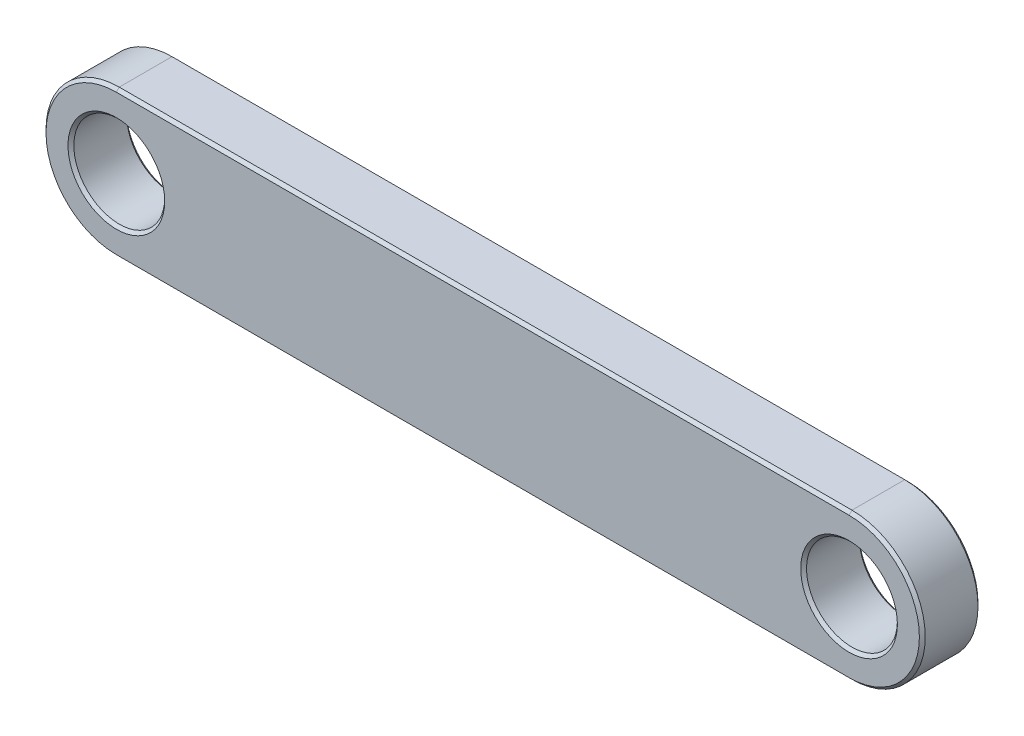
from build123d import *

# Parameters (mm, degrees)
SKETCH1_R           = 1.55
BOSS_EXTRUDE1_DEPTH = 2
CHAMFER1_SIZE       = 0.1


with BuildPart() as part:
    # Sketch1 → Boss-Extrude1 (new body)
    with BuildSketch(Plane.XY):
        with BuildLine():
            Line((12.5, -2.5), (-12.5, -2.5))
            ThreePointArc((-12.5, -2.5), (-15, 0), (-12.5, 2.5))
            Line((-12.5, 2.5), (12.5, 2.5))
            ThreePointArc((12.5, 2.5), (15, 0), (12.5, -2.5))
        make_face()
        with Locations((-12.5, 0)):
            Circle(SKETCH1_R, mode=Mode.SUBTRACT)
        with Locations((12.5, 0)):
            Circle(SKETCH1_R, mode=Mode.SUBTRACT)
    extrude(amount=BOSS_EXTRUDE1_DEPTH)

    # Chamfer1
    chamfer1_edges = [part.edges().sort_by_distance(p)[0] for p in [
        (-14.05, 0, 0),
        (-14.05, 0, 2),
        (-15, 0, 2),
        (10.95, 0, 0),
        (10.95, 0, 2),
        (0, -2.5, 2),
        (15, 0, 2),
        (0, -2.5, 0),
        (-15, 0, 0),
        (0, 2.5, 0),
        (15, 0, 0),
        (0, 2.5, 2),
    ]]
    chamfer(chamfer1_edges, length=CHAMFER1_SIZE)


solid = part.part
